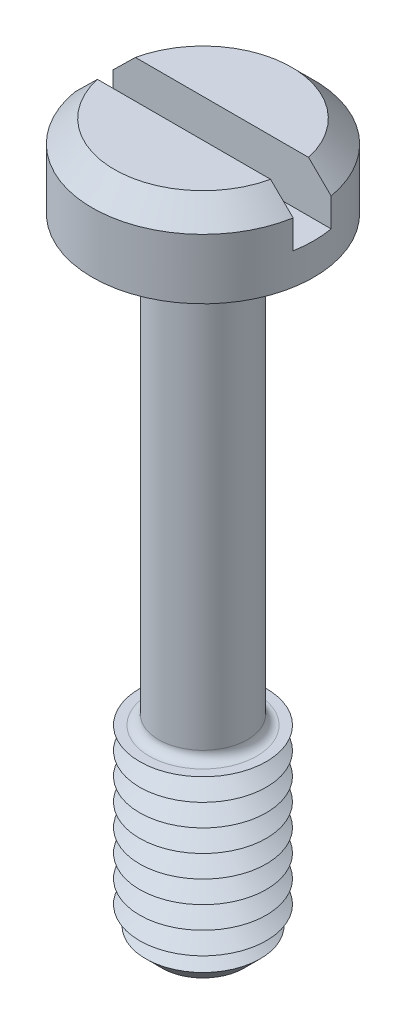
from build123d import *

# Parameters (mm, degrees)
SKETCH1_R           = 3.5
BOSS_EXTRUDE1_DEPTH = 2.6
SKETCH2_R           = 1.4
BOSS_EXTRUDE2_DEPTH = 20
SKETCH3_R           = 2
BOSS_EXTRUDE3_DEPTH = 6
CHAMFER1_SIZE       = 0.7
LPATTERN1_COUNT     = 8
LPATTERN1_PITCH     = 0.7
FILLET1_R           = 0.3
CHAMFER2_SIZE       = 0.7
SKETCH6_W           = 7
SKETCH6_H           = 1.2
CUT_EXTRUDE1_DEPTH  = 1.6


with BuildPart() as part:
    # Sketch1 → Boss-Extrude1 (new body)
    with BuildSketch(Plane(origin=(0, 0, 0), x_dir=(1, 0, 0), z_dir=(0, 1, 0))):
        with Locations(Location((0, 0, 0), (0, 0, 270))):
            Circle(SKETCH1_R)
    extrude(amount=BOSS_EXTRUDE1_DEPTH)

    # Sketch2 → Boss-Extrude2 (add)
    with BuildSketch(Plane.XZ):
        with Locations(Location((0, 0, 0), (0, 0, 270))):
            Circle(SKETCH2_R)
    extrude(amount=BOSS_EXTRUDE2_DEPTH)

    # Sketch3 → Boss-Extrude3 (add)
    with BuildSketch(Plane.XZ.offset(20)):
        with Locations(Location((0, 0, 0), (0, 0, 270))):
            Circle(SKETCH3_R)
    extrude(amount=-BOSS_EXTRUDE3_DEPTH)

    # Chamfer1
    chamfer1_edges = [part.edges().sort_by_distance(p)[0] for p in [
        (0, -20, 2),
    ]]
    chamfer(chamfer1_edges, length=CHAMFER1_SIZE)

    # Sketch5 → Cut-Revolve1 (revolve, cut)
    with BuildSketch(Plane(origin=(0, 0, 0), x_dir=(0, 0, -1), z_dir=(1, 0, 0))):
        Polygon((-2, -14), (-1.393782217, -14.35), (-2, -14.7), align=None)
    cut_revolve1 = revolve(axis=Axis((0, -6.58711856, 0), (0, -1, 0)), mode=Mode.SUBTRACT)

    # LPattern1: Cut-Revolve1 ×8
    with Locations(*[(0, -i * LPATTERN1_PITCH, 0) for i in range(1, LPATTERN1_COUNT)]):
        add(cut_revolve1, mode=Mode.SUBTRACT)

    # Fillet1
    fillet1_edges = [part.edges().sort_by_distance(p)[0] for p in [
        (0, 0, 1.4),
        (0, -14, 1.4),
    ]]
    fillet(fillet1_edges, radius=FILLET1_R)

    # Chamfer2
    chamfer2_edges = [part.edges().sort_by_distance(p)[0] for p in [
        (0, 2.6, -3.5),
    ]]
    chamfer(chamfer2_edges, length=CHAMFER2_SIZE)

    # Sketch6 → Cut-Extrude1 (cut)
    with BuildSketch(Plane(origin=(0, 2.6, 0), x_dir=(1, 0, 0), z_dir=(0, 1, 0))):
        Rectangle(SKETCH6_W, SKETCH6_H)
    extrude(amount=-CUT_EXTRUDE1_DEPTH, mode=Mode.SUBTRACT)


solid = part.part
